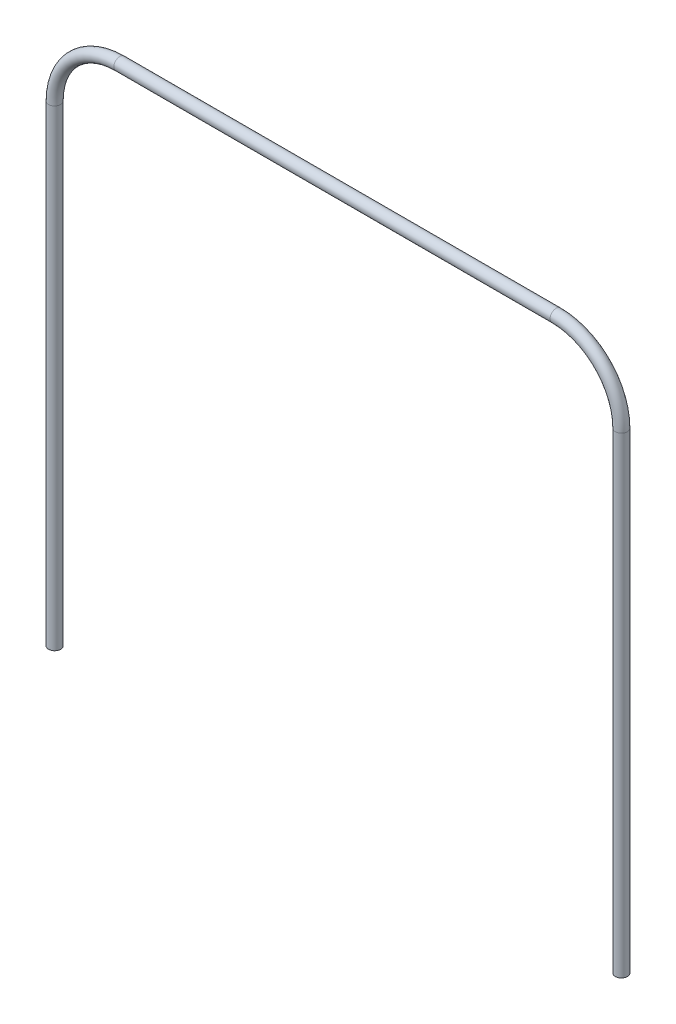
ISO-10303-21;
HEADER;
FILE_DESCRIPTION(('STEP AP214'),'2;1');
FILE_NAME('part.step','',(''),(''),'','','');
FILE_SCHEMA(('AUTOMOTIVE_DESIGN { 1 0 10303 214 1 1 1 1 }'));
ENDSEC;
DATA;
#1=APPLICATION_CONTEXT('core data for automotive mechanical design processes');
#2=APPLICATION_PROTOCOL_DEFINITION('international standard','automotive_design',2000,#1);
#3=PRODUCT_CONTEXT('',#1,'mechanical');
#4=PRODUCT('Part','Part','',(#3));
#5=PRODUCT_RELATED_PRODUCT_CATEGORY('part','',(#4));
#6=PRODUCT_DEFINITION_FORMATION('','',#4);
#7=PRODUCT_DEFINITION_CONTEXT('part definition',#1,'design');
#8=PRODUCT_DEFINITION('design','',#6,#7);
#9=PRODUCT_DEFINITION_SHAPE('','',#8);
#10=(LENGTH_UNIT() NAMED_UNIT(*) SI_UNIT(.MILLI.,.METRE.));
#11=(NAMED_UNIT(*) PLANE_ANGLE_UNIT() SI_UNIT($,.RADIAN.));
#12=(NAMED_UNIT(*) SI_UNIT($,.STERADIAN.) SOLID_ANGLE_UNIT());
#13=UNCERTAINTY_MEASURE_WITH_UNIT(LENGTH_MEASURE(1.E-05),#10,'distance_accuracy_value','');
#14=(GEOMETRIC_REPRESENTATION_CONTEXT(3) GLOBAL_UNCERTAINTY_ASSIGNED_CONTEXT((#13)) GLOBAL_UNIT_ASSIGNED_CONTEXT((#10,
#11,#12)) REPRESENTATION_CONTEXT('',''));
#15=CARTESIAN_POINT('',(0.,0.,0.));
#16=DIRECTION('',(0.,0.,1.));
#17=DIRECTION('',(1.,0.,0.));
#18=AXIS2_PLACEMENT_3D('',#15,#16,#17);
#19=CARTESIAN_POINT('',(564.550000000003,470.000000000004,1.66533453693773E-13));
#20=DIRECTION('',(0.,-1.00000000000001,0.));
#21=DIRECTION('',(1.,0.,0.));
#22=AXIS2_PLACEMENT_3D('',#19,#20,#21);
#23=CYLINDRICAL_SURFACE('',#22,6.);
#24=CARTESIAN_POINT('',(564.550000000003,470.000000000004,1.66533453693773E-13));
#25=DIRECTION('',(0.,-1.00000000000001,0.));
#26=DIRECTION('',(0.,0.,1.00000000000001));
#27=AXIS2_PLACEMENT_3D('',#24,#25,#26);
#28=CIRCLE('',#27,6.);
#29=CARTESIAN_POINT('',(570.55,470.000000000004,1.66533453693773E-13));
#30=VERTEX_POINT('',#29);
#31=EDGE_CURVE('E36',#30,#30,#28,.T.);
#32=ORIENTED_EDGE('',*,*,#31,.T.);
#33=EDGE_LOOP('',(#32));
#34=FACE_BOUND('',#33,.T.);
#35=CARTESIAN_POINT('',(564.55,2.22044604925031E-13,0.));
#36=DIRECTION('',(0.,-1.00000000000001,0.));
#37=DIRECTION('',(0.,0.,1.00000000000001));
#38=AXIS2_PLACEMENT_3D('',#35,#36,#37);
#39=CIRCLE('',#38,6.);
#40=CARTESIAN_POINT('',(564.55,2.22044604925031E-13,5.99999999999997));
#41=VERTEX_POINT('',#40);
#42=EDGE_CURVE('E10',#41,#41,#39,.T.);
#43=ORIENTED_EDGE('',*,*,#42,.F.);
#44=EDGE_LOOP('',(#43));
#45=FACE_BOUND('',#44,.T.);
#46=ADVANCED_FACE('F30',(#34,#45),#23,.T.);
#47=CARTESIAN_POINT('',(499.55,470.000000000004,1.66533453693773E-13));
#48=DIRECTION('',(0.,0.,-1.00000000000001));
#49=DIRECTION('',(-1.,0.,0.));
#50=AXIS2_PLACEMENT_3D('',#47,#48,#49);
#51=TOROIDAL_SURFACE('',#50,65.,6.);
#52=CARTESIAN_POINT('',(499.549999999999,535.000000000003,-4.71844785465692E-13));
#53=DIRECTION('',(1.,0.,0.));
#54=DIRECTION('',(0.,0.,1.00000000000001));
#55=AXIS2_PLACEMENT_3D('',#52,#53,#54);
#56=CIRCLE('',#55,6.);
#57=CARTESIAN_POINT('',(499.549999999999,541.000000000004,-5.30772007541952E-13));
#58=VERTEX_POINT('',#57);
#59=EDGE_CURVE('E40',#58,#58,#56,.T.);
#60=CARTESIAN_POINT('',(499.55,470.000000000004,1.66533453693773E-13));
#61=DIRECTION('',(0.,0.,-1.00000000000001));
#62=DIRECTION('',(-1.,0.,0.));
#63=AXIS2_PLACEMENT_3D('',#60,#61,#62);
#64=CIRCLE('',#63,71.);
#65=EDGE_CURVE('',#58,#30,#64,.T.);
#66=ORIENTED_EDGE('',*,*,#59,.T.);
#67=ORIENTED_EDGE('',*,*,#31,.F.);
#68=ORIENTED_EDGE('',*,*,#65,.T.);
#69=ORIENTED_EDGE('',*,*,#65,.F.);
#70=EDGE_LOOP('',(#66,#68,#67,#69));
#71=FACE_BOUND('',#70,.T.);
#72=ADVANCED_FACE('F67',(#71),#51,.T.);
#73=CARTESIAN_POINT('',(65.0000000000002,535.000000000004,0.));
#74=DIRECTION('',(1.,0.,0.));
#75=DIRECTION('',(0.,0.,-1.00000000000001));
#76=AXIS2_PLACEMENT_3D('',#73,#74,#75);
#77=CYLINDRICAL_SURFACE('',#76,6.);
#78=CARTESIAN_POINT('',(65.0000000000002,535.000000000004,0.));
#79=DIRECTION('',(1.,0.,0.));
#80=DIRECTION('',(0.,0.,1.00000000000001));
#81=AXIS2_PLACEMENT_3D('',#78,#79,#80);
#82=CIRCLE('',#81,6.);
#83=CARTESIAN_POINT('',(65.0000000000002,541.000000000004,0.));
#84=VERTEX_POINT('',#83);
#85=EDGE_CURVE('E44',#84,#84,#82,.T.);
#86=ORIENTED_EDGE('',*,*,#85,.T.);
#87=EDGE_LOOP('',(#86));
#88=FACE_BOUND('',#87,.T.);
#89=ORIENTED_EDGE('',*,*,#59,.F.);
#90=EDGE_LOOP('',(#89));
#91=FACE_BOUND('',#90,.T.);
#92=ADVANCED_FACE('F71',(#88,#91),#77,.T.);
#93=CARTESIAN_POINT('',(65.0000000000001,470.000000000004,1.66533453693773E-13));
#94=DIRECTION('',(0.,0.,-1.00000000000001));
#95=DIRECTION('',(-1.,0.,0.));
#96=AXIS2_PLACEMENT_3D('',#93,#94,#95);
#97=TOROIDAL_SURFACE('',#96,65.,6.);
#98=CARTESIAN_POINT('',(-3.33066907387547E-13,470.000000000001,-1.38777878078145E-13));
#99=DIRECTION('',(0.,1.00000000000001,0.));
#100=DIRECTION('',(0.,0.,1.00000000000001));
#101=AXIS2_PLACEMENT_3D('',#98,#99,#100);
#102=CIRCLE('',#101,6.);
#103=CARTESIAN_POINT('',(-5.99999999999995,470.000000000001,-1.66960462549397E-13));
#104=VERTEX_POINT('',#103);
#105=EDGE_CURVE('E49',#104,#104,#102,.T.);
#106=CARTESIAN_POINT('',(65.0000000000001,470.000000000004,1.66533453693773E-13));
#107=DIRECTION('',(0.,0.,-1.00000000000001));
#108=DIRECTION('',(-1.,0.,0.));
#109=AXIS2_PLACEMENT_3D('',#106,#107,#108);
#110=CIRCLE('',#109,71.);
#111=EDGE_CURVE('',#104,#84,#110,.T.);
#112=ORIENTED_EDGE('',*,*,#105,.T.);
#113=ORIENTED_EDGE('',*,*,#85,.F.);
#114=ORIENTED_EDGE('',*,*,#111,.T.);
#115=ORIENTED_EDGE('',*,*,#111,.F.);
#116=EDGE_LOOP('',(#112,#114,#113,#115));
#117=FACE_BOUND('',#116,.T.);
#118=ADVANCED_FACE('F77',(#117),#97,.T.);
#119=CARTESIAN_POINT('',(-3.33066907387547E-13,470.000000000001,-1.38777878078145E-13));
#120=DIRECTION('',(0.,-1.00000000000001,0.));
#121=DIRECTION('',(0.,0.,-1.00000000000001));
#122=AXIS2_PLACEMENT_3D('',#119,#120,#121);
#123=CYLINDRICAL_SURFACE('',#122,6.);
#124=ORIENTED_EDGE('',*,*,#105,.F.);
#125=EDGE_LOOP('',(#124));
#126=FACE_BOUND('',#125,.T.);
#127=CARTESIAN_POINT('',(0.,0.,0.));
#128=DIRECTION('',(0.,1.00000000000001,0.));
#129=DIRECTION('',(0.,0.,1.00000000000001));
#130=AXIS2_PLACEMENT_3D('',#127,#128,#129);
#131=CIRCLE('',#130,6.);
#132=CARTESIAN_POINT('',(0.,0.,6.00000000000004));
#133=VERTEX_POINT('',#132);
#134=EDGE_CURVE('E52',#133,#133,#131,.T.);
#135=ORIENTED_EDGE('',*,*,#134,.T.);
#136=EDGE_LOOP('',(#135));
#137=FACE_BOUND('',#136,.T.);
#138=ADVANCED_FACE('F56',(#126,#137),#123,.T.);
#139=CARTESIAN_POINT('',(564.55,2.22044604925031E-13,0.));
#140=DIRECTION('',(0.,-1.00000000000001,0.));
#141=DIRECTION('',(0.,0.,1.00000000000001));
#142=AXIS2_PLACEMENT_3D('',#139,#140,#141);
#143=PLANE('',#142);
#144=ORIENTED_EDGE('',*,*,#42,.T.);
#145=EDGE_LOOP('',(#144));
#146=FACE_BOUND('',#145,.T.);
#147=ADVANCED_FACE('F60',(#146),#143,.T.);
#148=CARTESIAN_POINT('',(0.,0.,0.));
#149=DIRECTION('',(0.,1.00000000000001,0.));
#150=DIRECTION('',(0.,0.,1.00000000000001));
#151=AXIS2_PLACEMENT_3D('',#148,#149,#150);
#152=PLANE('',#151);
#153=ORIENTED_EDGE('',*,*,#134,.F.);
#154=EDGE_LOOP('',(#153));
#155=FACE_BOUND('',#154,.T.);
#156=ADVANCED_FACE('F58',(#155),#152,.F.);
#157=CLOSED_SHELL('',(#46,#72,#92,#118,#138,#147,#156));
#158=MANIFOLD_SOLID_BREP('B2',#157);
#159=ADVANCED_BREP_SHAPE_REPRESENTATION('',(#18,#158),#14);
#160=SHAPE_DEFINITION_REPRESENTATION(#9,#159);
ENDSEC;
END-ISO-10303-21;
